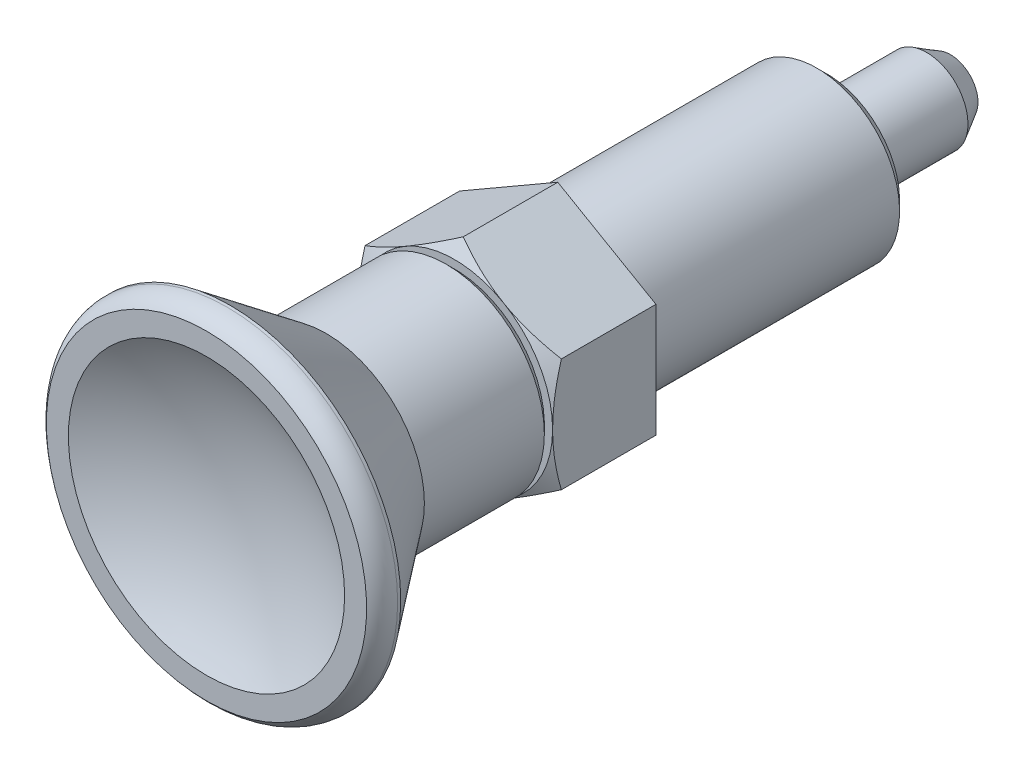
ISO-10303-21;
HEADER;
FILE_DESCRIPTION(('STEP AP214'),'2;1');
FILE_NAME('part.step','',(''),(''),'','','');
FILE_SCHEMA(('AUTOMOTIVE_DESIGN { 1 0 10303 214 1 1 1 1 }'));
ENDSEC;
DATA;
#1=APPLICATION_CONTEXT('core data for automotive mechanical design processes');
#2=APPLICATION_PROTOCOL_DEFINITION('international standard','automotive_design',2000,#1);
#3=PRODUCT_CONTEXT('',#1,'mechanical');
#4=PRODUCT('Part','Part','',(#3));
#5=PRODUCT_RELATED_PRODUCT_CATEGORY('part','',(#4));
#6=PRODUCT_DEFINITION_FORMATION('','',#4);
#7=PRODUCT_DEFINITION_CONTEXT('part definition',#1,'design');
#8=PRODUCT_DEFINITION('design','',#6,#7);
#9=PRODUCT_DEFINITION_SHAPE('','',#8);
#10=(LENGTH_UNIT() NAMED_UNIT(*) SI_UNIT(.MILLI.,.METRE.));
#11=(NAMED_UNIT(*) PLANE_ANGLE_UNIT() SI_UNIT($,.RADIAN.));
#12=(NAMED_UNIT(*) SI_UNIT($,.STERADIAN.) SOLID_ANGLE_UNIT());
#13=UNCERTAINTY_MEASURE_WITH_UNIT(LENGTH_MEASURE(1.E-05),#10,'distance_accuracy_value','');
#14=(GEOMETRIC_REPRESENTATION_CONTEXT(3) GLOBAL_UNCERTAINTY_ASSIGNED_CONTEXT((#13)) GLOBAL_UNIT_ASSIGNED_CONTEXT((#10,
#11,#12)) REPRESENTATION_CONTEXT('',''));
#15=CARTESIAN_POINT('',(0.,0.,0.));
#16=DIRECTION('',(0.,0.,1.));
#17=DIRECTION('',(1.,0.,0.));
#18=AXIS2_PLACEMENT_3D('',#15,#16,#17);
#19=CARTESIAN_POINT('',(0.,0.,8.2679491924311));
#20=DIRECTION('',(0.,0.,-1.));
#21=DIRECTION('',(0.,1.,0.));
#22=AXIS2_PLACEMENT_3D('',#19,#20,#21);
#23=CONICAL_SURFACE('',#22,12.5,1.0471975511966);
#24=CARTESIAN_POINT('',(-9.5,14.6694784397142,5.39450880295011));
#25=CARTESIAN_POINT('',(-9.5,14.4622891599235,5.49491189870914));
#26=CARTESIAN_POINT('',(-9.5,14.2548550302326,5.59480949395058));
#27=CARTESIAN_POINT('',(-9.5,13.8394459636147,5.79347906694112));
#28=CARTESIAN_POINT('',(-9.5,13.6314710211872,5.89225103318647));
#29=CARTESIAN_POINT('',(-9.5,13.006602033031,6.18673301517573));
#30=CARTESIAN_POINT('',(-9.5,12.588826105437,6.38057885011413));
#31=CARTESIAN_POINT('',(-9.5,11.7481529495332,6.76317238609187));
#32=CARTESIAN_POINT('',(-9.5,11.3252401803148,6.95188602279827));
#33=CARTESIAN_POINT('',(-9.5,10.4760294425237,7.32150846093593));
#34=CARTESIAN_POINT('',(-9.5,10.049731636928,7.50241763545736));
#35=CARTESIAN_POINT('',(-9.5,9.17954542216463,7.85992080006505));
#36=CARTESIAN_POINT('',(-9.5,8.73552637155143,8.03619856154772));
#37=CARTESIAN_POINT('',(-9.5,7.84227124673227,8.37525870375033));
#38=CARTESIAN_POINT('',(-9.5,7.39303459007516,8.53803956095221));
#39=CARTESIAN_POINT('',(-9.5,6.4894856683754,8.84578509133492));
#40=CARTESIAN_POINT('',(-9.5,6.03518601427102,8.99078638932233));
#41=CARTESIAN_POINT('',(-9.5,5.12008702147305,9.25828021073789));
#42=CARTESIAN_POINT('',(-9.5,4.65928979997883,9.38077989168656));
#43=CARTESIAN_POINT('',(-9.5,3.73340943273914,9.59669179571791));
#44=CARTESIAN_POINT('',(-9.5,3.26836362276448,9.69025977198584));
#45=CARTESIAN_POINT('',(-9.5,2.56661121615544,9.80483212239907));
#46=CARTESIAN_POINT('',(-9.5,2.33197870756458,9.83872787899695));
#47=CARTESIAN_POINT('',(-9.5,1.86156913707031,9.89725992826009));
#48=CARTESIAN_POINT('',(-9.5,1.62579218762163,9.92189711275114));
#49=CARTESIAN_POINT('',(-9.5,1.15646132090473,9.96111550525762));
#50=CARTESIAN_POINT('',(-9.5,0.922917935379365,9.97582227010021));
#51=CARTESIAN_POINT('',(-9.5,0.455418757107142,9.99535094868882));
#52=CARTESIAN_POINT('',(-9.5,0.22146297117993,10.0001730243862));
#53=CARTESIAN_POINT('',(-9.5,-0.246443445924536,9.99981749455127));
#54=CARTESIAN_POINT('',(-9.5,-0.480394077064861,9.99463983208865));
#55=CARTESIAN_POINT('',(-9.5,-0.947871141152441,9.97441012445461));
#56=CARTESIAN_POINT('',(-9.5,-1.18139755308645,9.9593576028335));
#57=CARTESIAN_POINT('',(-9.5,-1.7445817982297,9.91146533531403));
#58=CARTESIAN_POINT('',(-9.5,-2.07383902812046,9.8738322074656));
#59=CARTESIAN_POINT('',(-9.5,-2.72986967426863,9.7810005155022));
#60=CARTESIAN_POINT('',(-9.5,-3.05664273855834,9.72579950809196));
#61=CARTESIAN_POINT('',(-9.5,-3.70740775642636,9.59979590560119));
#62=CARTESIAN_POINT('',(-9.5,-4.03139728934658,9.52898092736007));
#63=CARTESIAN_POINT('',(-9.5,-4.6761066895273,9.373906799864));
#64=CARTESIAN_POINT('',(-9.5,-4.99682661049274,9.28964787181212));
#65=CARTESIAN_POINT('',(-9.5,-5.64198667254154,9.10775856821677));
#66=CARTESIAN_POINT('',(-9.5,-5.96635540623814,9.00987665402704));
#67=CARTESIAN_POINT('',(-9.5,-6.61189693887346,8.80414047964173));
#68=CARTESIAN_POINT('',(-9.5,-6.93306971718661,8.69628615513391));
#69=CARTESIAN_POINT('',(-9.5,-7.57238029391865,8.47230523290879));
#70=CARTESIAN_POINT('',(-9.5,-7.89051909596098,8.35618148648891));
#71=CARTESIAN_POINT('',(-9.5,-8.52417024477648,8.11701398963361));
#72=CARTESIAN_POINT('',(-9.5,-8.83968261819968,7.99397030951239));
#73=CARTESIAN_POINT('',(-9.5,-9.56690560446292,7.70264312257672));
#74=CARTESIAN_POINT('',(-9.5,-9.97777627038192,7.53226643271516));
#75=CARTESIAN_POINT('',(-9.5,-10.7961584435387,7.18360590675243));
#76=CARTESIAN_POINT('',(-9.5,-11.2036697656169,7.00532163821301));
#77=CARTESIAN_POINT('',(-9.5,-12.0159356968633,6.64238133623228));
#78=CARTESIAN_POINT('',(-9.5,-12.4206897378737,6.4577240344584));
#79=CARTESIAN_POINT('',(-9.5,-13.227804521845,6.08328256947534));
#80=CARTESIAN_POINT('',(-9.5,-13.6301653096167,5.89349850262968));
#81=CARTESIAN_POINT('',(-9.5,-14.4332842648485,5.50954217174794));
#82=CARTESIAN_POINT('',(-9.5,-14.8340404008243,5.31536566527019));
#83=CARTESIAN_POINT('',(-9.5,-15.6338491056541,4.92353700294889));
#84=CARTESIAN_POINT('',(-9.5,-16.0329016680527,4.72588483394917));
#85=CARTESIAN_POINT('',(-9.5,-17.2278077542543,4.12865993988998));
#86=CARTESIAN_POINT('',(-9.5,-18.0215048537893,3.72477296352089));
#87=CARTESIAN_POINT('',(-9.5,-19.541112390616,2.94159511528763));
#88=CARTESIAN_POINT('',(-9.5,-20.2673484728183,2.56293333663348));
#89=CARTESIAN_POINT('',(-9.5,-21.7170935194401,1.80037310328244));
#90=CARTESIAN_POINT('',(-9.5,-22.4406023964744,1.41647448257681));
#91=CARTESIAN_POINT('',(-9.5,-23.8837949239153,0.645570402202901));
#92=CARTESIAN_POINT('',(-9.5,-24.6034835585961,0.258574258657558));
#93=CARTESIAN_POINT('',(-9.5,-26.0411062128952,-0.518576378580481));
#94=CARTESIAN_POINT('',(-9.5,-26.7590403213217,-0.908730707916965));
#95=CARTESIAN_POINT('',(-9.5,-27.4763235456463,-1.30006997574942));
#96=B_SPLINE_CURVE_WITH_KNOTS('',3,(#24,#25,#26,#27,#28,#29,#30,#31,#32,#33,#34,#35,#36,#37,#38,
#39,#40,#41,#42,#43,#44,#45,#46,#47,#48,#49,#50,#51,#52,#53,#54,#55,#56,#57,#58,#59,#60,#61,#62,
#63,#64,#65,#66,#67,#68,#69,#70,#71,#72,#73,#74,#75,#76,#77,#78,#79,#80,#81,#82,#83,#84,#85,#86,
#87,#88,#89,#90,#91,#92,#93,#94,#95),.UNSPECIFIED.,.F.,.F.,(4,2,2,2,2,2,2,2,2,2,2,2,2,2,2,2,2,2,
2,2,2,2,2,2,2,2,2,2,2,2,2,2,2,2,2,4),(0.,0.690703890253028,1.38141483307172,2.7630444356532,
4.15230370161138,5.54149648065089,6.97451891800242,8.40770289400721,9.83788314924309,
11.2676076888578,12.6894956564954,13.4005463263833,14.1115284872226,14.8133439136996,
15.5151478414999,16.2169557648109,16.9187975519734,17.9124490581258,18.906238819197,
19.9008195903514,20.8953839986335,21.9116385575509,22.927899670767,23.9438120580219,
24.9597141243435,26.2939897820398,27.6283384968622,28.9629543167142,30.2975450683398,
31.6334850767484,32.9694301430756,35.6410033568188,38.0980584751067,40.5551916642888,
43.0066032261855,45.4578880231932),.UNSPECIFIED.);
#97=CARTESIAN_POINT('',(-9.5,-5.4848275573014,9.15149422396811));
#98=VERTEX_POINT('',#97);
#99=CARTESIAN_POINT('',(-9.5,0.,10.));
#100=VERTEX_POINT('',#99);
#101=EDGE_CURVE('E9',#98,#100,#96,.F.);
#102=ORIENTED_EDGE('',*,*,#101,.F.);
#103=CARTESIAN_POINT('',(0.000200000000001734,-10.9697705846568,9.15142755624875));
#104=CARTESIAN_POINT('',(-0.208630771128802,-10.8492020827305,9.22102656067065));
#105=CARTESIAN_POINT('',(-0.418240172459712,-10.7281840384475,9.28746669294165));
#106=CARTESIAN_POINT('',(-0.839139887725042,-10.4851774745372,9.41315271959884));
#107=CARTESIAN_POINT('',(-1.05043073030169,-10.3631886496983,9.47239624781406));
#108=CARTESIAN_POINT('',(-1.68770779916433,-9.99525656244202,9.63818542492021));
#109=CARTESIAN_POINT('',(-2.11620976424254,-9.74786083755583,9.73248555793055));
#110=CARTESIAN_POINT('',(-2.75744333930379,-9.37764446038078,9.8430612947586));
#111=CARTESIAN_POINT('',(-2.9682592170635,-9.25592985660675,9.87456017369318));
#112=CARTESIAN_POINT('',(-3.39086703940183,-9.01193711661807,9.92738179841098));
#113=CARTESIAN_POINT('',(-3.60265900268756,-8.88965896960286,9.94870434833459));
#114=CARTESIAN_POINT('',(-4.02659621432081,-8.64489870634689,9.9806269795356));
#115=CARTESIAN_POINT('',(-4.23874074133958,-8.52241700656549,9.99123980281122));
#116=CARTESIAN_POINT('',(-4.66322575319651,-8.27734047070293,10.001517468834));
#117=CARTESIAN_POINT('',(-4.87556623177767,-8.15474563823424,10.0011826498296));
#118=CARTESIAN_POINT('',(-5.27254199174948,-7.92555157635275,9.99032663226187));
#119=CARTESIAN_POINT('',(-5.45720529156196,-7.81893617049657,9.98112973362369));
#120=CARTESIAN_POINT('',(-5.82610000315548,-7.60595470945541,9.95463460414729));
#121=CARTESIAN_POINT('',(-6.01033138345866,-7.49958867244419,9.93733580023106));
#122=CARTESIAN_POINT('',(-6.56231167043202,-7.18090270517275,9.8736955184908));
#123=CARTESIAN_POINT('',(-6.92908353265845,-6.96914687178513,9.81561809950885));
#124=CARTESIAN_POINT('',(-7.66651782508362,-6.54338898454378,9.67042398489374));
#125=CARTESIAN_POINT('',(-8.03708614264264,-6.32944126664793,9.58269183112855));
#126=CARTESIAN_POINT('',(-8.77269671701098,-5.90473630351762,9.38357626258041));
#127=CARTESIAN_POINT('',(-9.137748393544,-5.69397361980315,9.27223961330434));
#128=CARTESIAN_POINT('',(-9.5002,-5.48471208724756,9.15142755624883));
#129=B_SPLINE_CURVE_WITH_KNOTS('',3,(#103,#104,#105,#106,#107,#108,#109,#110,#111,#112,#113,
#114,#115,#116,#117,#118,#119,#120,#121,#122,#123,#124,#125,#126,#127,#128),.UNSPECIFIED.,.F.,
.F.,(4,2,2,2,2,2,2,2,2,2,2,2,4),(0.,0.752880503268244,1.50600787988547,3.01546870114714,
3.75167336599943,4.48789219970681,5.22323407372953,5.95855322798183,6.59868084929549,
7.23885375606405,8.52010929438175,9.82978009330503,11.1368800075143),.UNSPECIFIED.);
#130=CARTESIAN_POINT('',(-4.75000000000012,-8.22724133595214,10.));
#131=VERTEX_POINT('',#130);
#132=EDGE_CURVE('E201',#131,#98,#129,.T.);
#133=ORIENTED_EDGE('',*,*,#132,.F.);
#134=CARTESIAN_POINT('',(0.,0.,10.));
#135=DIRECTION('',(0.,0.,1.));
#136=DIRECTION('',(0.,-1.,0.));
#137=AXIS2_PLACEMENT_3D('',#134,#135,#136);
#138=CIRCLE('',#137,9.5);
#139=EDGE_CURVE('E259',#100,#131,#138,.T.);
#140=ORIENTED_EDGE('',*,*,#139,.F.);
#141=EDGE_LOOP('',(#102,#133,#140));
#142=FACE_BOUND('',#141,.T.);
#143=ADVANCED_FACE('F14',(#142),#23,.T.);
#144=CARTESIAN_POINT('',(-9.5,5.4848275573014,9.15149422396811));
#145=VERTEX_POINT('',#144);
#146=EDGE_CURVE('E18',#100,#145,#96,.F.);
#147=ORIENTED_EDGE('',*,*,#146,.F.);
#148=CARTESIAN_POINT('',(-4.75000000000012,8.22724133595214,10.));
#149=VERTEX_POINT('',#148);
#150=EDGE_CURVE('E116',#149,#100,#138,.T.);
#151=ORIENTED_EDGE('',*,*,#150,.F.);
#152=CARTESIAN_POINT('',(-9.5002,5.48471208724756,9.15142755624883));
#153=CARTESIAN_POINT('',(-9.2913692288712,5.60528058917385,9.22102656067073));
#154=CARTESIAN_POINT('',(-9.08175982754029,5.72629863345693,9.28746669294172));
#155=CARTESIAN_POINT('',(-8.66086011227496,5.96930519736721,9.41315271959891));
#156=CARTESIAN_POINT('',(-8.44956926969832,6.09129402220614,9.47239624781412));
#157=CARTESIAN_POINT('',(-7.81229220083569,6.45922610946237,9.63818542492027));
#158=CARTESIAN_POINT('',(-7.38379023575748,6.70662183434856,9.7324855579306));
#159=CARTESIAN_POINT('',(-6.74255666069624,7.07683821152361,9.84306129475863));
#160=CARTESIAN_POINT('',(-6.53174078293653,7.19855281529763,9.87456017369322));
#161=CARTESIAN_POINT('',(-6.1091329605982,7.44254555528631,9.927381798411));
#162=CARTESIAN_POINT('',(-5.89734099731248,7.56482370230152,9.94870434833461));
#163=CARTESIAN_POINT('',(-5.47340378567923,7.80958396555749,9.98062697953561));
#164=CARTESIAN_POINT('',(-5.26125925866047,7.93206566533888,9.99123980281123));
#165=CARTESIAN_POINT('',(-4.83677424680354,8.17714220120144,10.0015174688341));
#166=CARTESIAN_POINT('',(-4.62443376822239,8.29973703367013,10.0011826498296));
#167=CARTESIAN_POINT('',(-4.22745800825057,8.52893109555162,9.99032663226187));
#168=CARTESIAN_POINT('',(-4.04279470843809,8.6355465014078,9.98112973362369));
#169=CARTESIAN_POINT('',(-3.67389999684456,8.84852796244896,9.95463460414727));
#170=CARTESIAN_POINT('',(-3.48966861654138,8.95489399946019,9.93733580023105));
#171=CARTESIAN_POINT('',(-2.93768832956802,9.27357996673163,9.87369551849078));
#172=CARTESIAN_POINT('',(-2.57091646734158,9.48533580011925,9.81561809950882));
#173=CARTESIAN_POINT('',(-1.8334821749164,9.9110936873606,9.67042398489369));
#174=CARTESIAN_POINT('',(-1.46291385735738,10.1250414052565,9.5826918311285));
#175=CARTESIAN_POINT('',(-0.727303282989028,10.5497463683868,9.38357626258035));
#176=CARTESIAN_POINT('',(-0.362251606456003,10.7605090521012,9.27223961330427));
#177=CARTESIAN_POINT('',(0.000199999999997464,10.9697705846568,9.15142755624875));
#178=B_SPLINE_CURVE_WITH_KNOTS('',3,(#152,#153,#154,#155,#156,#157,#158,#159,#160,#161,#162,
#163,#164,#165,#166,#167,#168,#169,#170,#171,#172,#173,#174,#175,#176,#177),.UNSPECIFIED.,.F.,
.F.,(4,2,2,2,2,2,2,2,2,2,2,2,4),(0.,0.752880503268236,1.50600787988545,3.0154687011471,
3.75167336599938,4.48789219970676,5.22323407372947,5.95855322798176,6.59868084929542,
7.23885375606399,8.52010929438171,9.829780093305,11.1368800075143),.UNSPECIFIED.);
#179=EDGE_CURVE('E262',#145,#149,#178,.T.);
#180=ORIENTED_EDGE('',*,*,#179,.F.);
#181=EDGE_LOOP('',(#147,#151,#180));
#182=FACE_BOUND('',#181,.T.);
#183=ADVANCED_FACE('F223',(#182),#23,.T.);
#184=CARTESIAN_POINT('',(0.,10.969655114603,9.15149422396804));
#185=VERTEX_POINT('',#184);
#186=EDGE_CURVE('E112',#149,#185,#178,.T.);
#187=ORIENTED_EDGE('',*,*,#186,.F.);
#188=CARTESIAN_POINT('',(4.75000000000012,8.22724133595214,10.));
#189=VERTEX_POINT('',#188);
#190=EDGE_CURVE('E110',#189,#149,#138,.T.);
#191=ORIENTED_EDGE('',*,*,#190,.F.);
#192=CARTESIAN_POINT('',(-0.000200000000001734,10.9697705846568,9.15142755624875));
#193=CARTESIAN_POINT('',(0.208630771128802,10.8492020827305,9.22102656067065));
#194=CARTESIAN_POINT('',(0.418240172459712,10.7281840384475,9.28746669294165));
#195=CARTESIAN_POINT('',(0.839139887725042,10.4851774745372,9.41315271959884));
#196=CARTESIAN_POINT('',(1.05043073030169,10.3631886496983,9.47239624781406));
#197=CARTESIAN_POINT('',(1.68770779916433,9.99525656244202,9.63818542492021));
#198=CARTESIAN_POINT('',(2.11620976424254,9.74786083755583,9.73248555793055));
#199=CARTESIAN_POINT('',(2.75744333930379,9.37764446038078,9.8430612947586));
#200=CARTESIAN_POINT('',(2.9682592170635,9.25592985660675,9.87456017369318));
#201=CARTESIAN_POINT('',(3.39086703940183,9.01193711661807,9.92738179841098));
#202=CARTESIAN_POINT('',(3.60265900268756,8.88965896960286,9.94870434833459));
#203=CARTESIAN_POINT('',(4.02659621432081,8.64489870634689,9.9806269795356));
#204=CARTESIAN_POINT('',(4.23874074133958,8.52241700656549,9.99123980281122));
#205=CARTESIAN_POINT('',(4.66322575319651,8.27734047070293,10.001517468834));
#206=CARTESIAN_POINT('',(4.87556623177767,8.15474563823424,10.0011826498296));
#207=CARTESIAN_POINT('',(5.27254199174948,7.92555157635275,9.99032663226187));
#208=CARTESIAN_POINT('',(5.45720529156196,7.81893617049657,9.98112973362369));
#209=CARTESIAN_POINT('',(5.82610000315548,7.60595470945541,9.95463460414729));
#210=CARTESIAN_POINT('',(6.01033138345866,7.49958867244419,9.93733580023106));
#211=CARTESIAN_POINT('',(6.56231167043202,7.18090270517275,9.8736955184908));
#212=CARTESIAN_POINT('',(6.92908353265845,6.96914687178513,9.81561809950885));
#213=CARTESIAN_POINT('',(7.66651782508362,6.54338898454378,9.67042398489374));
#214=CARTESIAN_POINT('',(8.03708614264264,6.32944126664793,9.58269183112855));
#215=CARTESIAN_POINT('',(8.77269671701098,5.90473630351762,9.38357626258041));
#216=CARTESIAN_POINT('',(9.137748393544,5.69397361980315,9.27223961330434));
#217=CARTESIAN_POINT('',(9.5002,5.48471208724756,9.15142755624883));
#218=B_SPLINE_CURVE_WITH_KNOTS('',3,(#192,#193,#194,#195,#196,#197,#198,#199,#200,#201,#202,
#203,#204,#205,#206,#207,#208,#209,#210,#211,#212,#213,#214,#215,#216,#217),.UNSPECIFIED.,.F.,
.F.,(4,2,2,2,2,2,2,2,2,2,2,2,4),(0.,0.752880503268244,1.50600787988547,3.01546870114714,
3.75167336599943,4.48789219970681,5.22323407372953,5.95855322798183,6.59868084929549,
7.23885375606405,8.52010929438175,9.82978009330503,11.1368800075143),.UNSPECIFIED.);
#219=EDGE_CURVE('E90',#185,#189,#218,.T.);
#220=ORIENTED_EDGE('',*,*,#219,.F.);
#221=EDGE_LOOP('',(#187,#191,#220));
#222=FACE_BOUND('',#221,.T.);
#223=ADVANCED_FACE('F111',(#222),#23,.T.);
#224=CARTESIAN_POINT('',(0.,-10.969655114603,9.15149422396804));
#225=VERTEX_POINT('',#224);
#226=EDGE_CURVE('E196',#225,#131,#129,.T.);
#227=ORIENTED_EDGE('',*,*,#226,.F.);
#228=CARTESIAN_POINT('',(9.5002,-5.48471208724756,9.15142755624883));
#229=CARTESIAN_POINT('',(9.2913692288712,-5.60528058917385,9.22102656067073));
#230=CARTESIAN_POINT('',(9.08175982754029,-5.72629863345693,9.28746669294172));
#231=CARTESIAN_POINT('',(8.66086011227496,-5.96930519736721,9.41315271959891));
#232=CARTESIAN_POINT('',(8.44956926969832,-6.09129402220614,9.47239624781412));
#233=CARTESIAN_POINT('',(7.81229220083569,-6.45922610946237,9.63818542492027));
#234=CARTESIAN_POINT('',(7.38379023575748,-6.70662183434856,9.7324855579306));
#235=CARTESIAN_POINT('',(6.74255666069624,-7.07683821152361,9.84306129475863));
#236=CARTESIAN_POINT('',(6.53174078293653,-7.19855281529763,9.87456017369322));
#237=CARTESIAN_POINT('',(6.1091329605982,-7.44254555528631,9.927381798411));
#238=CARTESIAN_POINT('',(5.89734099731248,-7.56482370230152,9.94870434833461));
#239=CARTESIAN_POINT('',(5.47340378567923,-7.80958396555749,9.98062697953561));
#240=CARTESIAN_POINT('',(5.26125925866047,-7.93206566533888,9.99123980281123));
#241=CARTESIAN_POINT('',(4.83677424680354,-8.17714220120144,10.0015174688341));
#242=CARTESIAN_POINT('',(4.62443376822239,-8.29973703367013,10.0011826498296));
#243=CARTESIAN_POINT('',(4.22745800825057,-8.52893109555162,9.99032663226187));
#244=CARTESIAN_POINT('',(4.04279470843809,-8.6355465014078,9.98112973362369));
#245=CARTESIAN_POINT('',(3.67389999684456,-8.84852796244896,9.95463460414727));
#246=CARTESIAN_POINT('',(3.48966861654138,-8.95489399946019,9.93733580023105));
#247=CARTESIAN_POINT('',(2.93768832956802,-9.27357996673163,9.87369551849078));
#248=CARTESIAN_POINT('',(2.57091646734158,-9.48533580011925,9.81561809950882));
#249=CARTESIAN_POINT('',(1.8334821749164,-9.9110936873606,9.67042398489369));
#250=CARTESIAN_POINT('',(1.46291385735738,-10.1250414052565,9.5826918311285));
#251=CARTESIAN_POINT('',(0.727303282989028,-10.5497463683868,9.38357626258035));
#252=CARTESIAN_POINT('',(0.362251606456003,-10.7605090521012,9.27223961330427));
#253=CARTESIAN_POINT('',(-0.000199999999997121,-10.9697705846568,9.15142755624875));
#254=B_SPLINE_CURVE_WITH_KNOTS('',3,(#228,#229,#230,#231,#232,#233,#234,#235,#236,#237,#238,
#239,#240,#241,#242,#243,#244,#245,#246,#247,#248,#249,#250,#251,#252,#253),.UNSPECIFIED.,.F.,
.F.,(4,2,2,2,2,2,2,2,2,2,2,2,4),(0.,0.752880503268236,1.50600787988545,3.0154687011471,
3.75167336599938,4.48789219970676,5.22323407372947,5.95855322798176,6.59868084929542,
7.23885375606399,8.52010929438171,9.829780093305,11.1368800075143),.UNSPECIFIED.);
#255=CARTESIAN_POINT('',(4.75000000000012,-8.22724133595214,10.));
#256=VERTEX_POINT('',#255);
#257=EDGE_CURVE('E100',#256,#225,#254,.T.);
#258=ORIENTED_EDGE('',*,*,#257,.F.);
#259=EDGE_CURVE('E123',#131,#256,#138,.T.);
#260=ORIENTED_EDGE('',*,*,#259,.F.);
#261=EDGE_LOOP('',(#227,#258,#260));
#262=FACE_BOUND('',#261,.T.);
#263=ADVANCED_FACE('F241',(#262),#23,.T.);
#264=CARTESIAN_POINT('',(9.5,5.4848275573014,9.15149422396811));
#265=VERTEX_POINT('',#264);
#266=EDGE_CURVE('E94',#189,#265,#218,.T.);
#267=ORIENTED_EDGE('',*,*,#266,.F.);
#268=CARTESIAN_POINT('',(9.5,0.,10.));
#269=VERTEX_POINT('',#268);
#270=EDGE_CURVE('E106',#269,#189,#138,.T.);
#271=ORIENTED_EDGE('',*,*,#270,.F.);
#272=CARTESIAN_POINT('',(9.5,14.6694784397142,5.39450880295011));
#273=CARTESIAN_POINT('',(9.5,14.4622891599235,5.49491189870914));
#274=CARTESIAN_POINT('',(9.5,14.2548550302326,5.59480949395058));
#275=CARTESIAN_POINT('',(9.5,13.8394459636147,5.79347906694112));
#276=CARTESIAN_POINT('',(9.5,13.6314710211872,5.89225103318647));
#277=CARTESIAN_POINT('',(9.5,13.006602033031,6.18673301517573));
#278=CARTESIAN_POINT('',(9.5,12.588826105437,6.38057885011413));
#279=CARTESIAN_POINT('',(9.5,11.7481529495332,6.76317238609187));
#280=CARTESIAN_POINT('',(9.5,11.3252401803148,6.95188602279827));
#281=CARTESIAN_POINT('',(9.5,10.4760294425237,7.32150846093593));
#282=CARTESIAN_POINT('',(9.5,10.049731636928,7.50241763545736));
#283=CARTESIAN_POINT('',(9.5,9.17954542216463,7.85992080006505));
#284=CARTESIAN_POINT('',(9.5,8.73552637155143,8.03619856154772));
#285=CARTESIAN_POINT('',(9.5,7.84227124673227,8.37525870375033));
#286=CARTESIAN_POINT('',(9.5,7.39303459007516,8.53803956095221));
#287=CARTESIAN_POINT('',(9.5,6.4894856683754,8.84578509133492));
#288=CARTESIAN_POINT('',(9.5,6.03518601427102,8.99078638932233));
#289=CARTESIAN_POINT('',(9.5,5.12008702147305,9.25828021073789));
#290=CARTESIAN_POINT('',(9.5,4.65928979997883,9.38077989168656));
#291=CARTESIAN_POINT('',(9.5,3.73340943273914,9.59669179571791));
#292=CARTESIAN_POINT('',(9.5,3.26836362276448,9.69025977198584));
#293=CARTESIAN_POINT('',(9.5,2.56661121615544,9.80483212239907));
#294=CARTESIAN_POINT('',(9.5,2.33197870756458,9.83872787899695));
#295=CARTESIAN_POINT('',(9.5,1.86156913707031,9.89725992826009));
#296=CARTESIAN_POINT('',(9.5,1.62579218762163,9.92189711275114));
#297=CARTESIAN_POINT('',(9.5,1.15646132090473,9.96111550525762));
#298=CARTESIAN_POINT('',(9.5,0.922917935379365,9.97582227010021));
#299=CARTESIAN_POINT('',(9.5,0.455418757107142,9.99535094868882));
#300=CARTESIAN_POINT('',(9.5,0.22146297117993,10.0001730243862));
#301=CARTESIAN_POINT('',(9.5,-0.246443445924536,9.99981749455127));
#302=CARTESIAN_POINT('',(9.5,-0.480394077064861,9.99463983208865));
#303=CARTESIAN_POINT('',(9.5,-0.947871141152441,9.97441012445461));
#304=CARTESIAN_POINT('',(9.5,-1.18139755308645,9.9593576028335));
#305=CARTESIAN_POINT('',(9.5,-1.7445817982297,9.91146533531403));
#306=CARTESIAN_POINT('',(9.5,-2.07383902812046,9.8738322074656));
#307=CARTESIAN_POINT('',(9.5,-2.72986967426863,9.7810005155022));
#308=CARTESIAN_POINT('',(9.5,-3.05664273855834,9.72579950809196));
#309=CARTESIAN_POINT('',(9.5,-3.70740775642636,9.59979590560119));
#310=CARTESIAN_POINT('',(9.5,-4.03139728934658,9.52898092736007));
#311=CARTESIAN_POINT('',(9.5,-4.6761066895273,9.373906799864));
#312=CARTESIAN_POINT('',(9.5,-4.99682661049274,9.28964787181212));
#313=CARTESIAN_POINT('',(9.5,-5.64198667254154,9.10775856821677));
#314=CARTESIAN_POINT('',(9.5,-5.96635540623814,9.00987665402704));
#315=CARTESIAN_POINT('',(9.5,-6.61189693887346,8.80414047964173));
#316=CARTESIAN_POINT('',(9.5,-6.93306971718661,8.69628615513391));
#317=CARTESIAN_POINT('',(9.5,-7.57238029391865,8.47230523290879));
#318=CARTESIAN_POINT('',(9.5,-7.89051909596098,8.35618148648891));
#319=CARTESIAN_POINT('',(9.5,-8.52417024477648,8.11701398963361));
#320=CARTESIAN_POINT('',(9.5,-8.83968261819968,7.99397030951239));
#321=CARTESIAN_POINT('',(9.5,-9.56690560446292,7.70264312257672));
#322=CARTESIAN_POINT('',(9.5,-9.97777627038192,7.53226643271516));
#323=CARTESIAN_POINT('',(9.5,-10.7961584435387,7.18360590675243));
#324=CARTESIAN_POINT('',(9.5,-11.2036697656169,7.00532163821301));
#325=CARTESIAN_POINT('',(9.5,-12.0159356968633,6.64238133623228));
#326=CARTESIAN_POINT('',(9.5,-12.4206897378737,6.4577240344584));
#327=CARTESIAN_POINT('',(9.5,-13.227804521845,6.08328256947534));
#328=CARTESIAN_POINT('',(9.5,-13.6301653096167,5.89349850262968));
#329=CARTESIAN_POINT('',(9.5,-14.4332842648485,5.50954217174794));
#330=CARTESIAN_POINT('',(9.5,-14.8340404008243,5.31536566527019));
#331=CARTESIAN_POINT('',(9.5,-15.6338491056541,4.92353700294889));
#332=CARTESIAN_POINT('',(9.5,-16.0329016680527,4.72588483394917));
#333=CARTESIAN_POINT('',(9.5,-17.2278077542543,4.12865993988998));
#334=CARTESIAN_POINT('',(9.5,-18.0215048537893,3.72477296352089));
#335=CARTESIAN_POINT('',(9.5,-19.541112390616,2.94159511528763));
#336=CARTESIAN_POINT('',(9.5,-20.2673484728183,2.56293333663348));
#337=CARTESIAN_POINT('',(9.5,-21.7170935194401,1.80037310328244));
#338=CARTESIAN_POINT('',(9.5,-22.4406023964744,1.41647448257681));
#339=CARTESIAN_POINT('',(9.5,-23.8837949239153,0.645570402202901));
#340=CARTESIAN_POINT('',(9.5,-24.6034835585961,0.258574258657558));
#341=CARTESIAN_POINT('',(9.5,-26.0411062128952,-0.518576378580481));
#342=CARTESIAN_POINT('',(9.5,-26.7590403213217,-0.908730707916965));
#343=CARTESIAN_POINT('',(9.5,-27.4763235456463,-1.30006997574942));
#344=B_SPLINE_CURVE_WITH_KNOTS('',3,(#272,#273,#274,#275,#276,#277,#278,#279,#280,#281,#282,
#283,#284,#285,#286,#287,#288,#289,#290,#291,#292,#293,#294,#295,#296,#297,#298,#299,#300,#301,
#302,#303,#304,#305,#306,#307,#308,#309,#310,#311,#312,#313,#314,#315,#316,#317,#318,#319,#320,
#321,#322,#323,#324,#325,#326,#327,#328,#329,#330,#331,#332,#333,#334,#335,#336,#337,#338,#339,
#340,#341,#342,#343),.UNSPECIFIED.,.F.,.F.,(4,2,2,2,2,2,2,2,2,2,2,2,2,2,2,2,2,2,2,2,2,2,2,2,2,2,
2,2,2,2,2,2,2,2,2,4),(0.,0.690703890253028,1.38141483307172,2.7630444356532,4.15230370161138,
5.54149648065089,6.97451891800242,8.40770289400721,9.83788314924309,11.2676076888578,
12.6894956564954,13.4005463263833,14.1115284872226,14.8133439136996,15.5151478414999,
16.2169557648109,16.9187975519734,17.9124490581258,18.906238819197,19.9008195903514,
20.8953839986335,21.9116385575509,22.927899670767,23.9438120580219,24.9597141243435,
26.2939897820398,27.6283384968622,28.9629543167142,30.2975450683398,31.6334850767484,
32.9694301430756,35.6410033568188,38.0980584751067,40.5551916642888,43.0066032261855,
45.4578880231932),.UNSPECIFIED.);
#345=EDGE_CURVE('E41',#265,#269,#344,.T.);
#346=ORIENTED_EDGE('',*,*,#345,.F.);
#347=EDGE_LOOP('',(#267,#271,#346));
#348=FACE_BOUND('',#347,.T.);
#349=ADVANCED_FACE('F104',(#348),#23,.T.);
#350=CARTESIAN_POINT('',(9.5,-5.4848275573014,9.15149422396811));
#351=VERTEX_POINT('',#350);
#352=EDGE_CURVE('E108',#351,#256,#254,.T.);
#353=ORIENTED_EDGE('',*,*,#352,.F.);
#354=EDGE_CURVE('E166',#269,#351,#344,.T.);
#355=ORIENTED_EDGE('',*,*,#354,.F.);
#356=EDGE_CURVE('E121',#256,#269,#138,.T.);
#357=ORIENTED_EDGE('',*,*,#356,.F.);
#358=EDGE_LOOP('',(#353,#355,#357));
#359=FACE_BOUND('',#358,.T.);
#360=ADVANCED_FACE('F225',(#359),#23,.T.);
#361=CARTESIAN_POINT('',(-2.8275992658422E-12,0.,56.3000000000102));
#362=DIRECTION('',(0.,0.,1.));
#363=DIRECTION('',(1.,0.,0.));
#364=AXIS2_PLACEMENT_3D('',#361,#362,#363);
#365=SPHERICAL_SURFACE('',#364,26.0000000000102);
#366=CARTESIAN_POINT('',(0.,0.,34.));
#367=DIRECTION('',(0.,0.,1.));
#368=DIRECTION('',(0.,-1.,0.));
#369=AXIS2_PLACEMENT_3D('',#366,#367,#368);
#370=CIRCLE('',#369,13.36824595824);
#371=CARTESIAN_POINT('',(0.,-13.36824595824,34.));
#372=VERTEX_POINT('',#371);
#373=EDGE_CURVE('E163',#372,#372,#370,.T.);
#374=ORIENTED_EDGE('',*,*,#373,.T.);
#375=EDGE_LOOP('',(#374));
#376=FACE_BOUND('',#375,.T.);
#377=ADVANCED_FACE('F16',(#376),#365,.F.);
#378=CARTESIAN_POINT('',(13.36824595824,0.,34.));
#379=DIRECTION('',(0.,0.,1.));
#380=DIRECTION('',(0.,-1.,0.));
#381=AXIS2_PLACEMENT_3D('',#378,#379,#380);
#382=PLANE('',#381);
#383=CARTESIAN_POINT('',(0.,0.,34.));
#384=DIRECTION('',(0.,0.,1.));
#385=DIRECTION('',(0.,-1.,0.));
#386=AXIS2_PLACEMENT_3D('',#383,#384,#385);
#387=CIRCLE('',#386,15.5);
#388=CARTESIAN_POINT('',(0.,-15.5,34.));
#389=VERTEX_POINT('',#388);
#390=EDGE_CURVE('E160',#389,#389,#387,.T.);
#391=ORIENTED_EDGE('',*,*,#390,.T.);
#392=EDGE_LOOP('',(#391));
#393=FACE_BOUND('',#392,.T.);
#394=ORIENTED_EDGE('',*,*,#373,.F.);
#395=EDGE_LOOP('',(#394));
#396=FACE_BOUND('',#395,.T.);
#397=ADVANCED_FACE('F239',(#393,#396),#382,.T.);
#398=CARTESIAN_POINT('',(0.,0.,32.000000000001));
#399=DIRECTION('',(0.,0.,1.));
#400=DIRECTION('',(0.,-1.,0.));
#401=AXIS2_PLACEMENT_3D('',#398,#399,#400);
#402=TOROIDAL_SURFACE('',#401,14.000000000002,2.499999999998);
#403=CARTESIAN_POINT('',(0.,0.,32.));
#404=DIRECTION('',(0.,0.,1.));
#405=DIRECTION('',(0.,-1.,0.));
#406=AXIS2_PLACEMENT_3D('',#403,#404,#405);
#407=CIRCLE('',#406,16.5);
#408=CARTESIAN_POINT('',(0.,-16.5,32.));
#409=VERTEX_POINT('',#408);
#410=EDGE_CURVE('E157',#409,#409,#407,.T.);
#411=ORIENTED_EDGE('',*,*,#410,.T.);
#412=EDGE_LOOP('',(#411));
#413=FACE_BOUND('',#412,.T.);
#414=ORIENTED_EDGE('',*,*,#390,.F.);
#415=EDGE_LOOP('',(#414));
#416=FACE_BOUND('',#415,.T.);
#417=ADVANCED_FACE('F335',(#413,#416),#402,.T.);
#418=CARTESIAN_POINT('',(0.,0.,-38.));
#419=DIRECTION('',(0.,0.,1.));
#420=DIRECTION('',(0.,-1.,0.));
#421=AXIS2_PLACEMENT_3D('',#418,#419,#420);
#422=CYLINDRICAL_SURFACE('',#421,16.5);
#423=CARTESIAN_POINT('',(0.,0.,31.7));
#424=DIRECTION('',(0.,0.,1.));
#425=DIRECTION('',(0.,-1.,0.));
#426=AXIS2_PLACEMENT_3D('',#423,#424,#425);
#427=CIRCLE('',#426,16.5);
#428=CARTESIAN_POINT('',(0.,-16.5,31.7));
#429=VERTEX_POINT('',#428);
#430=EDGE_CURVE('E154',#429,#429,#427,.T.);
#431=ORIENTED_EDGE('',*,*,#430,.T.);
#432=EDGE_LOOP('',(#431));
#433=FACE_BOUND('',#432,.T.);
#434=ORIENTED_EDGE('',*,*,#410,.F.);
#435=EDGE_LOOP('',(#434));
#436=FACE_BOUND('',#435,.T.);
#437=ADVANCED_FACE('F331',(#433,#436),#422,.T.);
#438=CARTESIAN_POINT('',(0.,0.,31.7));
#439=DIRECTION('',(0.,0.,1.));
#440=DIRECTION('',(0.,-1.,0.));
#441=AXIS2_PLACEMENT_3D('',#438,#439,#440);
#442=CONICAL_SURFACE('',#441,16.5,0.645771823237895);
#443=CARTESIAN_POINT('',(0.,0.,22.410686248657));
#444=DIRECTION('',(0.,0.,1.));
#445=DIRECTION('',(0.,-1.,0.));
#446=AXIS2_PLACEMENT_3D('',#443,#444,#445);
#447=CIRCLE('',#446,9.5);
#448=CARTESIAN_POINT('',(0.,-9.5,22.410686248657));
#449=VERTEX_POINT('',#448);
#450=EDGE_CURVE('E151',#449,#449,#447,.T.);
#451=ORIENTED_EDGE('',*,*,#450,.T.);
#452=EDGE_LOOP('',(#451));
#453=FACE_BOUND('',#452,.T.);
#454=ORIENTED_EDGE('',*,*,#430,.F.);
#455=EDGE_LOOP('',(#454));
#456=FACE_BOUND('',#455,.T.);
#457=ADVANCED_FACE('F327',(#453,#456),#442,.T.);
#458=CARTESIAN_POINT('',(0.,0.,-38.));
#459=DIRECTION('',(0.,0.,1.));
#460=DIRECTION('',(0.,-1.,0.));
#461=AXIS2_PLACEMENT_3D('',#458,#459,#460);
#462=CYLINDRICAL_SURFACE('',#461,9.5);
#463=CARTESIAN_POINT('',(0.,0.,10.8));
#464=DIRECTION('',(0.,0.,1.));
#465=DIRECTION('',(0.,-1.,0.));
#466=AXIS2_PLACEMENT_3D('',#463,#464,#465);
#467=CIRCLE('',#466,9.5);
#468=CARTESIAN_POINT('',(0.,-9.5,10.8));
#469=VERTEX_POINT('',#468);
#470=EDGE_CURVE('E148',#469,#469,#467,.T.);
#471=ORIENTED_EDGE('',*,*,#470,.T.);
#472=EDGE_LOOP('',(#471));
#473=FACE_BOUND('',#472,.T.);
#474=ORIENTED_EDGE('',*,*,#450,.F.);
#475=EDGE_LOOP('',(#474));
#476=FACE_BOUND('',#475,.T.);
#477=ADVANCED_FACE('F323',(#473,#476),#462,.T.);
#478=CARTESIAN_POINT('',(0.,0.,10.8));
#479=DIRECTION('',(0.,0.,1.));
#480=DIRECTION('',(0.,-1.,0.));
#481=AXIS2_PLACEMENT_3D('',#478,#479,#480);
#482=CONICAL_SURFACE('',#481,9.5,0.785398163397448);
#483=CARTESIAN_POINT('',(0.,0.,10.));
#484=DIRECTION('',(0.,0.,1.));
#485=DIRECTION('',(0.,-1.,0.));
#486=AXIS2_PLACEMENT_3D('',#483,#484,#485);
#487=CIRCLE('',#486,8.7);
#488=CARTESIAN_POINT('',(0.,-8.7,10.));
#489=VERTEX_POINT('',#488);
#490=EDGE_CURVE('E145',#489,#489,#487,.T.);
#491=ORIENTED_EDGE('',*,*,#490,.T.);
#492=EDGE_LOOP('',(#491));
#493=FACE_BOUND('',#492,.T.);
#494=ORIENTED_EDGE('',*,*,#470,.F.);
#495=EDGE_LOOP('',(#494));
#496=FACE_BOUND('',#495,.T.);
#497=ADVANCED_FACE('F312',(#493,#496),#482,.T.);
#498=CARTESIAN_POINT('',(9.5,0.,10.));
#499=DIRECTION('',(0.,0.,-1.));
#500=DIRECTION('',(0.,1.,0.));
#501=AXIS2_PLACEMENT_3D('',#498,#499,#500);
#502=PLANE('',#501);
#503=ORIENTED_EDGE('',*,*,#490,.F.);
#504=EDGE_LOOP('',(#503));
#505=FACE_BOUND('',#504,.T.);
#506=ORIENTED_EDGE('',*,*,#356,.T.);
#507=ORIENTED_EDGE('',*,*,#270,.T.);
#508=ORIENTED_EDGE('',*,*,#190,.T.);
#509=ORIENTED_EDGE('',*,*,#150,.T.);
#510=ORIENTED_EDGE('',*,*,#139,.T.);
#511=ORIENTED_EDGE('',*,*,#259,.T.);
#512=EDGE_LOOP('',(#506,#507,#508,#509,#510,#511));
#513=FACE_BOUND('',#512,.T.);
#514=ADVANCED_FACE('F118',(#505,#513),#502,.F.);
#515=CARTESIAN_POINT('',(9.5,5.4848275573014,-2.));
#516=DIRECTION('',(0.500000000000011,0.866025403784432,0.));
#517=DIRECTION('',(-0.866025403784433,0.500000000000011,0.));
#518=AXIS2_PLACEMENT_3D('',#515,#516,#517);
#519=PLANE('',#518);
#520=DIRECTION('',(-0.866025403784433,0.500000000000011,0.));
#521=VECTOR('',#520,1.);
#522=CARTESIAN_POINT('',(10.75,4.76313972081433,0.));
#523=LINE('',#522,#521);
#524=CARTESIAN_POINT('',(9.5,5.4848275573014,0.));
#525=VERTEX_POINT('',#524);
#526=CARTESIAN_POINT('',(0.,10.969655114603,0.));
#527=VERTEX_POINT('',#526);
#528=EDGE_CURVE('E126',#525,#527,#523,.T.);
#529=ORIENTED_EDGE('',*,*,#528,.T.);
#530=DIRECTION('',(0.,0.,1.));
#531=VECTOR('',#530,1.);
#532=CARTESIAN_POINT('',(0.,10.969655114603,-2.));
#533=LINE('',#532,#531);
#534=EDGE_CURVE('E96',#527,#185,#533,.T.);
#535=ORIENTED_EDGE('',*,*,#534,.T.);
#536=ORIENTED_EDGE('',*,*,#219,.T.);
#537=ORIENTED_EDGE('',*,*,#266,.T.);
#538=DIRECTION('',(0.,0.,1.));
#539=VECTOR('',#538,1.);
#540=CARTESIAN_POINT('',(9.5,5.4848275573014,-2.));
#541=LINE('',#540,#539);
#542=EDGE_CURVE('E282',#525,#265,#541,.T.);
#543=ORIENTED_EDGE('',*,*,#542,.F.);
#544=EDGE_LOOP('',(#529,#535,#536,#537,#543));
#545=FACE_BOUND('',#544,.T.);
#546=ADVANCED_FACE('F92',(#545),#519,.T.);
#547=CARTESIAN_POINT('',(0.,10.969655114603,-2.));
#548=DIRECTION('',(-0.500000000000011,0.866025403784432,0.));
#549=DIRECTION('',(-0.866025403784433,-0.500000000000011,0.));
#550=AXIS2_PLACEMENT_3D('',#547,#548,#549);
#551=PLANE('',#550);
#552=DIRECTION('',(-0.866025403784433,-0.500000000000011,0.));
#553=VECTOR('',#552,1.);
#554=CARTESIAN_POINT('',(1.2499999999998,11.6913429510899,0.));
#555=LINE('',#554,#553);
#556=CARTESIAN_POINT('',(-9.5,5.4848275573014,0.));
#557=VERTEX_POINT('',#556);
#558=EDGE_CURVE('E266',#527,#557,#555,.T.);
#559=ORIENTED_EDGE('',*,*,#558,.T.);
#560=DIRECTION('',(0.,0.,1.));
#561=VECTOR('',#560,1.);
#562=CARTESIAN_POINT('',(-9.5,5.4848275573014,-2.));
#563=LINE('',#562,#561);
#564=EDGE_CURVE('E269',#557,#145,#563,.T.);
#565=ORIENTED_EDGE('',*,*,#564,.T.);
#566=ORIENTED_EDGE('',*,*,#179,.T.);
#567=ORIENTED_EDGE('',*,*,#186,.T.);
#568=ORIENTED_EDGE('',*,*,#534,.F.);
#569=EDGE_LOOP('',(#559,#565,#566,#567,#568));
#570=FACE_BOUND('',#569,.T.);
#571=ADVANCED_FACE('F190',(#570),#551,.T.);
#572=CARTESIAN_POINT('',(-9.5,5.4848275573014,-2.));
#573=DIRECTION('',(-1.,0.,0.));
#574=DIRECTION('',(0.,-1.,0.));
#575=AXIS2_PLACEMENT_3D('',#572,#573,#574);
#576=PLANE('',#575);
#577=DIRECTION('',(0.,-1.,0.));
#578=VECTOR('',#577,1.);
#579=CARTESIAN_POINT('',(-9.5,0.,0.));
#580=LINE('',#579,#578);
#581=CARTESIAN_POINT('',(-9.5,-5.4848275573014,0.));
#582=VERTEX_POINT('',#581);
#583=EDGE_CURVE('E275',#557,#582,#580,.T.);
#584=ORIENTED_EDGE('',*,*,#583,.T.);
#585=DIRECTION('',(0.,0.,1.));
#586=VECTOR('',#585,1.);
#587=CARTESIAN_POINT('',(-9.5,-5.4848275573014,-2.));
#588=LINE('',#587,#586);
#589=EDGE_CURVE('E256',#582,#98,#588,.T.);
#590=ORIENTED_EDGE('',*,*,#589,.T.);
#591=ORIENTED_EDGE('',*,*,#101,.T.);
#592=ORIENTED_EDGE('',*,*,#146,.T.);
#593=ORIENTED_EDGE('',*,*,#564,.F.);
#594=EDGE_LOOP('',(#584,#590,#591,#592,#593));
#595=FACE_BOUND('',#594,.T.);
#596=ADVANCED_FACE('F210',(#595),#576,.T.);
#597=CARTESIAN_POINT('',(-9.5,-5.4848275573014,-2.));
#598=DIRECTION('',(-0.500000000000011,-0.866025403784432,0.));
#599=DIRECTION('',(0.866025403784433,-0.500000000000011,0.));
#600=AXIS2_PLACEMENT_3D('',#597,#598,#599);
#601=PLANE('',#600);
#602=DIRECTION('',(0.866025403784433,-0.500000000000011,0.));
#603=VECTOR('',#602,1.);
#604=CARTESIAN_POINT('',(1.2499999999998,-11.6913429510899,0.));
#605=LINE('',#604,#603);
#606=CARTESIAN_POINT('',(0.,-10.969655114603,0.));
#607=VERTEX_POINT('',#606);
#608=EDGE_CURVE('E255',#582,#607,#605,.T.);
#609=ORIENTED_EDGE('',*,*,#608,.T.);
#610=DIRECTION('',(0.,0.,1.));
#611=VECTOR('',#610,1.);
#612=CARTESIAN_POINT('',(0.,-10.969655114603,-2.));
#613=LINE('',#612,#611);
#614=EDGE_CURVE('E247',#607,#225,#613,.T.);
#615=ORIENTED_EDGE('',*,*,#614,.T.);
#616=ORIENTED_EDGE('',*,*,#226,.T.);
#617=ORIENTED_EDGE('',*,*,#132,.T.);
#618=ORIENTED_EDGE('',*,*,#589,.F.);
#619=EDGE_LOOP('',(#609,#615,#616,#617,#618));
#620=FACE_BOUND('',#619,.T.);
#621=ADVANCED_FACE('F207',(#620),#601,.T.);
#622=CARTESIAN_POINT('',(0.,-10.969655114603,-2.));
#623=DIRECTION('',(0.500000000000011,-0.866025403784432,0.));
#624=DIRECTION('',(0.866025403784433,0.500000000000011,0.));
#625=AXIS2_PLACEMENT_3D('',#622,#623,#624);
#626=PLANE('',#625);
#627=DIRECTION('',(0.866025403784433,0.500000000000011,0.));
#628=VECTOR('',#627,1.);
#629=CARTESIAN_POINT('',(10.75,-4.76313972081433,0.));
#630=LINE('',#629,#628);
#631=CARTESIAN_POINT('',(9.5,-5.4848275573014,0.));
#632=VERTEX_POINT('',#631);
#633=EDGE_CURVE('E279',#607,#632,#630,.T.);
#634=ORIENTED_EDGE('',*,*,#633,.T.);
#635=DIRECTION('',(0.,0.,1.));
#636=VECTOR('',#635,1.);
#637=CARTESIAN_POINT('',(9.5,-5.4848275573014,-2.));
#638=LINE('',#637,#636);
#639=EDGE_CURVE('E35',#632,#351,#638,.T.);
#640=ORIENTED_EDGE('',*,*,#639,.T.);
#641=ORIENTED_EDGE('',*,*,#352,.T.);
#642=ORIENTED_EDGE('',*,*,#257,.T.);
#643=ORIENTED_EDGE('',*,*,#614,.F.);
#644=EDGE_LOOP('',(#634,#640,#641,#642,#643));
#645=FACE_BOUND('',#644,.T.);
#646=ADVANCED_FACE('F185',(#645),#626,.T.);
#647=CARTESIAN_POINT('',(9.5,-5.4848275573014,-2.));
#648=DIRECTION('',(1.,0.,0.));
#649=DIRECTION('',(0.,1.,0.));
#650=AXIS2_PLACEMENT_3D('',#647,#648,#649);
#651=PLANE('',#650);
#652=DIRECTION('',(0.,1.,0.));
#653=VECTOR('',#652,1.);
#654=CARTESIAN_POINT('',(9.5,0.,0.));
#655=LINE('',#654,#653);
#656=EDGE_CURVE('E268',#632,#525,#655,.T.);
#657=ORIENTED_EDGE('',*,*,#656,.T.);
#658=ORIENTED_EDGE('',*,*,#542,.T.);
#659=ORIENTED_EDGE('',*,*,#345,.T.);
#660=ORIENTED_EDGE('',*,*,#354,.T.);
#661=ORIENTED_EDGE('',*,*,#639,.F.);
#662=EDGE_LOOP('',(#657,#658,#659,#660,#661));
#663=FACE_BOUND('',#662,.T.);
#664=ADVANCED_FACE('F181',(#663),#651,.T.);
#665=CARTESIAN_POINT('',(8.,0.,0.));
#666=DIRECTION('',(0.,0.,1.));
#667=DIRECTION('',(0.,-1.,0.));
#668=AXIS2_PLACEMENT_3D('',#665,#666,#667);
#669=PLANE('',#668);
#670=CARTESIAN_POINT('',(0.,0.,0.));
#671=DIRECTION('',(0.,0.,1.));
#672=DIRECTION('',(0.,-1.,0.));
#673=AXIS2_PLACEMENT_3D('',#670,#671,#672);
#674=CIRCLE('',#673,8.);
#675=CARTESIAN_POINT('',(0.,-8.,0.));
#676=VERTEX_POINT('',#675);
#677=EDGE_CURVE('E122',#676,#676,#674,.T.);
#678=ORIENTED_EDGE('',*,*,#677,.T.);
#679=EDGE_LOOP('',(#678));
#680=FACE_BOUND('',#679,.T.);
#681=ORIENTED_EDGE('',*,*,#528,.F.);
#682=ORIENTED_EDGE('',*,*,#656,.F.);
#683=ORIENTED_EDGE('',*,*,#633,.F.);
#684=ORIENTED_EDGE('',*,*,#608,.F.);
#685=ORIENTED_EDGE('',*,*,#583,.F.);
#686=ORIENTED_EDGE('',*,*,#558,.F.);
#687=EDGE_LOOP('',(#681,#682,#683,#684,#685,#686));
#688=FACE_BOUND('',#687,.T.);
#689=ADVANCED_FACE('F184',(#680,#688),#669,.F.);
#690=CARTESIAN_POINT('',(2.6720943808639,0.,-38.));
#691=DIRECTION('',(0.,0.,-1.));
#692=DIRECTION('',(0.,1.,0.));
#693=AXIS2_PLACEMENT_3D('',#690,#691,#692);
#694=PLANE('',#693);
#695=CARTESIAN_POINT('',(0.,0.,-38.));
#696=DIRECTION('',(0.,0.,1.));
#697=DIRECTION('',(0.,-1.,0.));
#698=AXIS2_PLACEMENT_3D('',#695,#696,#697);
#699=CIRCLE('',#698,2.6720943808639);
#700=CARTESIAN_POINT('',(0.,-2.6720943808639,-38.));
#701=VERTEX_POINT('',#700);
#702=EDGE_CURVE('E139',#701,#701,#699,.T.);
#703=ORIENTED_EDGE('',*,*,#702,.F.);
#704=EDGE_LOOP('',(#703));
#705=FACE_BOUND('',#704,.T.);
#706=ADVANCED_FACE('F288',(#705),#694,.T.);
#707=CARTESIAN_POINT('',(0.,0.,-35.7));
#708=DIRECTION('',(0.,0.,1.));
#709=DIRECTION('',(0.,-1.,0.));
#710=AXIS2_PLACEMENT_3D('',#707,#708,#709);
#711=CONICAL_SURFACE('',#710,4.,0.523598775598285);
#712=ORIENTED_EDGE('',*,*,#702,.T.);
#713=EDGE_LOOP('',(#712));
#714=FACE_BOUND('',#713,.T.);
#715=CARTESIAN_POINT('',(0.,0.,-35.7));
#716=DIRECTION('',(0.,0.,1.));
#717=DIRECTION('',(0.,-1.,0.));
#718=AXIS2_PLACEMENT_3D('',#715,#716,#717);
#719=CIRCLE('',#718,4.);
#720=CARTESIAN_POINT('',(0.,-4.,-35.7));
#721=VERTEX_POINT('',#720);
#722=EDGE_CURVE('E142',#721,#721,#719,.T.);
#723=ORIENTED_EDGE('',*,*,#722,.F.);
#724=EDGE_LOOP('',(#723));
#725=FACE_BOUND('',#724,.T.);
#726=ADVANCED_FACE('F294',(#714,#725),#711,.T.);
#727=CARTESIAN_POINT('',(0.,0.,-38.));
#728=DIRECTION('',(0.,0.,1.));
#729=DIRECTION('',(0.,-1.,0.));
#730=AXIS2_PLACEMENT_3D('',#727,#728,#729);
#731=CYLINDRICAL_SURFACE('',#730,4.);
#732=ORIENTED_EDGE('',*,*,#722,.T.);
#733=EDGE_LOOP('',(#732));
#734=FACE_BOUND('',#733,.T.);
#735=CARTESIAN_POINT('',(0.,0.,-26.));
#736=DIRECTION('',(0.,0.,1.));
#737=DIRECTION('',(0.,-1.,0.));
#738=AXIS2_PLACEMENT_3D('',#735,#736,#737);
#739=CIRCLE('',#738,4.);
#740=CARTESIAN_POINT('',(0.,-4.,-26.));
#741=VERTEX_POINT('',#740);
#742=EDGE_CURVE('E136',#741,#741,#739,.T.);
#743=ORIENTED_EDGE('',*,*,#742,.F.);
#744=EDGE_LOOP('',(#743));
#745=FACE_BOUND('',#744,.T.);
#746=ADVANCED_FACE('F309',(#734,#745),#731,.T.);
#747=CARTESIAN_POINT('',(4.,0.,-26.));
#748=DIRECTION('',(0.,0.,1.));
#749=DIRECTION('',(0.,-1.,0.));
#750=AXIS2_PLACEMENT_3D('',#747,#748,#749);
#751=PLANE('',#750);
#752=CARTESIAN_POINT('',(0.,0.,-26.));
#753=DIRECTION('',(0.,0.,1.));
#754=DIRECTION('',(0.,-1.,0.));
#755=AXIS2_PLACEMENT_3D('',#752,#753,#754);
#756=CIRCLE('',#755,7.08);
#757=CARTESIAN_POINT('',(0.,-7.08,-26.));
#758=VERTEX_POINT('',#757);
#759=EDGE_CURVE('E133',#758,#758,#756,.T.);
#760=ORIENTED_EDGE('',*,*,#759,.F.);
#761=EDGE_LOOP('',(#760));
#762=FACE_BOUND('',#761,.T.);
#763=ORIENTED_EDGE('',*,*,#742,.T.);
#764=EDGE_LOOP('',(#763));
#765=FACE_BOUND('',#764,.T.);
#766=ADVANCED_FACE('F305',(#762,#765),#751,.F.);
#767=CARTESIAN_POINT('',(0.,0.,-26.));
#768=DIRECTION('',(0.,0.,1.));
#769=DIRECTION('',(0.,-1.,0.));
#770=AXIS2_PLACEMENT_3D('',#767,#768,#769);
#771=CONICAL_SURFACE('',#770,7.08,0.785398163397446);
#772=CARTESIAN_POINT('',(0.,0.,-25.08));
#773=DIRECTION('',(0.,0.,1.));
#774=DIRECTION('',(0.,-1.,0.));
#775=AXIS2_PLACEMENT_3D('',#772,#773,#774);
#776=CIRCLE('',#775,8.);
#777=CARTESIAN_POINT('',(0.,-8.,-25.08));
#778=VERTEX_POINT('',#777);
#779=EDGE_CURVE('E130',#778,#778,#776,.T.);
#780=ORIENTED_EDGE('',*,*,#779,.F.);
#781=EDGE_LOOP('',(#780));
#782=FACE_BOUND('',#781,.T.);
#783=ORIENTED_EDGE('',*,*,#759,.T.);
#784=EDGE_LOOP('',(#783));
#785=FACE_BOUND('',#784,.T.);
#786=ADVANCED_FACE('F301',(#782,#785),#771,.T.);
#787=CARTESIAN_POINT('',(0.,0.,-26.));
#788=DIRECTION('',(0.,0.,1.));
#789=DIRECTION('',(0.,-1.,0.));
#790=AXIS2_PLACEMENT_3D('',#787,#788,#789);
#791=CYLINDRICAL_SURFACE('',#790,8.);
#792=ORIENTED_EDGE('',*,*,#779,.T.);
#793=EDGE_LOOP('',(#792));
#794=FACE_BOUND('',#793,.T.);
#795=ORIENTED_EDGE('',*,*,#677,.F.);
#796=EDGE_LOOP('',(#795));
#797=FACE_BOUND('',#796,.T.);
#798=ADVANCED_FACE('F298',(#794,#797),#791,.T.);
#799=CLOSED_SHELL('',(#143,#183,#223,#263,#349,#360,#377,#397,#417,#437,#457,#477,#497,#514,
#546,#571,#596,#621,#646,#664,#689,#706,#726,#746,#766,#786,#798));
#800=MANIFOLD_SOLID_BREP('B1',#799);
#801=ADVANCED_BREP_SHAPE_REPRESENTATION('',(#18,#800),#14);
#802=SHAPE_DEFINITION_REPRESENTATION(#9,#801);
ENDSEC;
END-ISO-10303-21;
